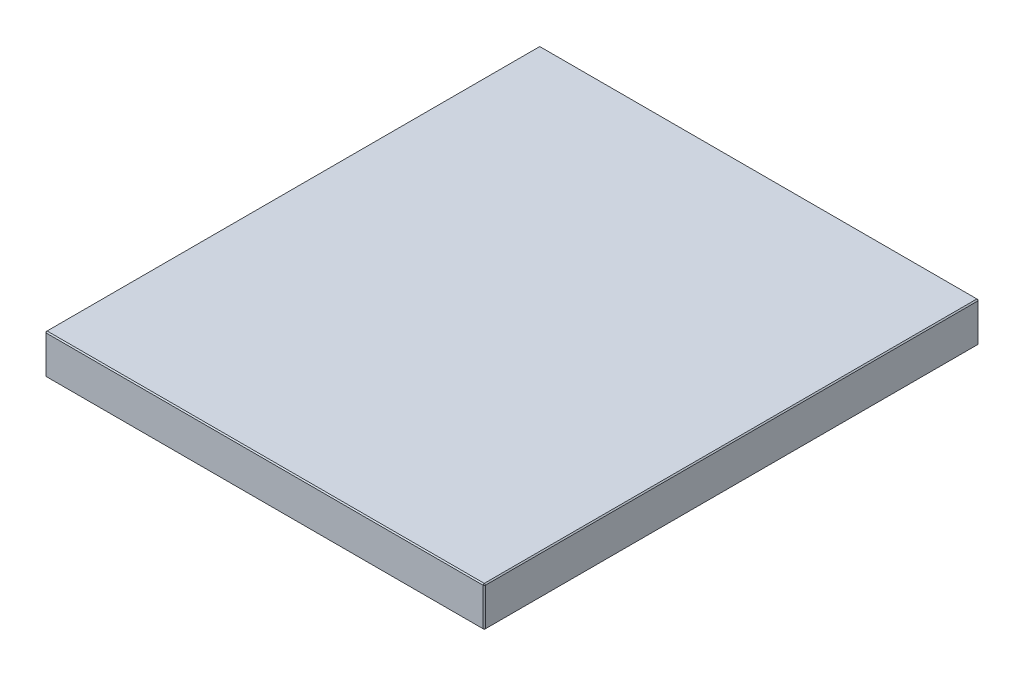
ISO-10303-21;
HEADER;
FILE_DESCRIPTION(('STEP AP214'),'2;1');
FILE_NAME('part.step','',(''),(''),'','','');
FILE_SCHEMA(('AUTOMOTIVE_DESIGN { 1 0 10303 214 1 1 1 1 }'));
ENDSEC;
DATA;
#1=APPLICATION_CONTEXT('core data for automotive mechanical design processes');
#2=APPLICATION_PROTOCOL_DEFINITION('international standard','automotive_design',2000,#1);
#3=PRODUCT_CONTEXT('',#1,'mechanical');
#4=PRODUCT('Part','Part','',(#3));
#5=PRODUCT_RELATED_PRODUCT_CATEGORY('part','',(#4));
#6=PRODUCT_DEFINITION_FORMATION('','',#4);
#7=PRODUCT_DEFINITION_CONTEXT('part definition',#1,'design');
#8=PRODUCT_DEFINITION('design','',#6,#7);
#9=PRODUCT_DEFINITION_SHAPE('','',#8);
#10=(LENGTH_UNIT() NAMED_UNIT(*) SI_UNIT(.MILLI.,.METRE.));
#11=(NAMED_UNIT(*) PLANE_ANGLE_UNIT() SI_UNIT($,.RADIAN.));
#12=(NAMED_UNIT(*) SI_UNIT($,.STERADIAN.) SOLID_ANGLE_UNIT());
#13=UNCERTAINTY_MEASURE_WITH_UNIT(LENGTH_MEASURE(1.E-05),#10,'distance_accuracy_value','');
#14=(GEOMETRIC_REPRESENTATION_CONTEXT(3) GLOBAL_UNCERTAINTY_ASSIGNED_CONTEXT((#13)) GLOBAL_UNIT_ASSIGNED_CONTEXT((#10,
#11,#12)) REPRESENTATION_CONTEXT('',''));
#15=CARTESIAN_POINT('',(0.,0.,0.));
#16=DIRECTION('',(0.,0.,1.));
#17=DIRECTION('',(1.,0.,0.));
#18=AXIS2_PLACEMENT_3D('',#15,#16,#17);
#19=CARTESIAN_POINT('',(198.,36.,223.));
#20=DIRECTION('',(-1.,0.,0.));
#21=DIRECTION('',(0.,0.,1.));
#22=AXIS2_PLACEMENT_3D('',#19,#20,#21);
#23=PLANE('',#22);
#24=DIRECTION('',(0.,0.,-1.));
#25=VECTOR('',#24,1.);
#26=CARTESIAN_POINT('',(198.,1.00000000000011,-223.));
#27=LINE('',#26,#25);
#28=CARTESIAN_POINT('',(198.,1.00000000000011,222.));
#29=VERTEX_POINT('',#28);
#30=CARTESIAN_POINT('',(198.,1.00000000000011,-222.));
#31=VERTEX_POINT('',#30);
#32=EDGE_CURVE('E151',#29,#31,#27,.T.);
#33=ORIENTED_EDGE('',*,*,#32,.T.);
#34=DIRECTION('',(0.,1.,0.));
#35=VECTOR('',#34,1.);
#36=CARTESIAN_POINT('',(198.,36.,-222.));
#37=LINE('',#36,#35);
#38=CARTESIAN_POINT('',(198.,35.,-222.));
#39=VERTEX_POINT('',#38);
#40=EDGE_CURVE('E153',#31,#39,#37,.T.);
#41=ORIENTED_EDGE('',*,*,#40,.T.);
#42=DIRECTION('',(0.,0.,1.));
#43=VECTOR('',#42,1.);
#44=CARTESIAN_POINT('',(198.,35.,223.));
#45=LINE('',#44,#43);
#46=CARTESIAN_POINT('',(198.,35.,222.));
#47=VERTEX_POINT('',#46);
#48=EDGE_CURVE('E147',#39,#47,#45,.T.);
#49=ORIENTED_EDGE('',*,*,#48,.T.);
#50=DIRECTION('',(0.,-1.,0.));
#51=VECTOR('',#50,1.);
#52=CARTESIAN_POINT('',(198.,36.,222.));
#53=LINE('',#52,#51);
#54=EDGE_CURVE('E149',#47,#29,#53,.T.);
#55=ORIENTED_EDGE('',*,*,#54,.T.);
#56=EDGE_LOOP('',(#33,#41,#49,#55));
#57=FACE_BOUND('',#56,.T.);
#58=ADVANCED_FACE('F16',(#57),#23,.F.);
#59=CARTESIAN_POINT('',(-198.,36.,-223.));
#60=DIRECTION('',(0.,0.,1.));
#61=DIRECTION('',(1.,0.,0.));
#62=AXIS2_PLACEMENT_3D('',#59,#60,#61);
#63=PLANE('',#62);
#64=DIRECTION('',(0.,-1.,0.));
#65=VECTOR('',#64,1.);
#66=CARTESIAN_POINT('',(197.,36.,-223.));
#67=LINE('',#66,#65);
#68=CARTESIAN_POINT('',(197.,35.,-223.));
#69=VERTEX_POINT('',#68);
#70=CARTESIAN_POINT('',(197.,1.00000000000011,-223.));
#71=VERTEX_POINT('',#70);
#72=EDGE_CURVE('E115',#69,#71,#67,.T.);
#73=ORIENTED_EDGE('',*,*,#72,.T.);
#74=DIRECTION('',(-1.,0.,0.));
#75=VECTOR('',#74,1.);
#76=CARTESIAN_POINT('',(-198.,1.00000000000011,-223.));
#77=LINE('',#76,#75);
#78=CARTESIAN_POINT('',(-197.,1.00000000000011,-223.));
#79=VERTEX_POINT('',#78);
#80=EDGE_CURVE('E111',#71,#79,#77,.T.);
#81=ORIENTED_EDGE('',*,*,#80,.T.);
#82=DIRECTION('',(0.,1.,0.));
#83=VECTOR('',#82,1.);
#84=CARTESIAN_POINT('',(-197.,36.,-223.));
#85=LINE('',#84,#83);
#86=CARTESIAN_POINT('',(-197.,35.,-223.));
#87=VERTEX_POINT('',#86);
#88=EDGE_CURVE('E103',#79,#87,#85,.T.);
#89=ORIENTED_EDGE('',*,*,#88,.T.);
#90=DIRECTION('',(1.,0.,0.));
#91=VECTOR('',#90,1.);
#92=CARTESIAN_POINT('',(-198.,35.,-223.));
#93=LINE('',#92,#91);
#94=EDGE_CURVE('E108',#87,#69,#93,.T.);
#95=ORIENTED_EDGE('',*,*,#94,.T.);
#96=EDGE_LOOP('',(#73,#81,#89,#95));
#97=FACE_BOUND('',#96,.T.);
#98=ADVANCED_FACE('F106',(#97),#63,.F.);
#99=CARTESIAN_POINT('',(-198.,36.,223.));
#100=DIRECTION('',(1.,0.,0.));
#101=DIRECTION('',(0.,0.,-1.));
#102=AXIS2_PLACEMENT_3D('',#99,#100,#101);
#103=PLANE('',#102);
#104=DIRECTION('',(0.,-1.,0.));
#105=VECTOR('',#104,1.);
#106=CARTESIAN_POINT('',(-198.,36.,-222.));
#107=LINE('',#106,#105);
#108=CARTESIAN_POINT('',(-198.,35.,-222.));
#109=VERTEX_POINT('',#108);
#110=CARTESIAN_POINT('',(-198.,1.00000000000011,-222.));
#111=VERTEX_POINT('',#110);
#112=EDGE_CURVE('E123',#109,#111,#107,.T.);
#113=ORIENTED_EDGE('',*,*,#112,.T.);
#114=DIRECTION('',(0.,0.,1.));
#115=VECTOR('',#114,1.);
#116=CARTESIAN_POINT('',(-198.,1.00000000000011,223.));
#117=LINE('',#116,#115);
#118=CARTESIAN_POINT('',(-198.,1.00000000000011,222.));
#119=VERTEX_POINT('',#118);
#120=EDGE_CURVE('E161',#111,#119,#117,.T.);
#121=ORIENTED_EDGE('',*,*,#120,.T.);
#122=DIRECTION('',(0.,1.,0.));
#123=VECTOR('',#122,1.);
#124=CARTESIAN_POINT('',(-198.,36.,222.));
#125=LINE('',#124,#123);
#126=CARTESIAN_POINT('',(-198.,35.,222.));
#127=VERTEX_POINT('',#126);
#128=EDGE_CURVE('E158',#119,#127,#125,.T.);
#129=ORIENTED_EDGE('',*,*,#128,.T.);
#130=DIRECTION('',(0.,0.,-1.));
#131=VECTOR('',#130,1.);
#132=CARTESIAN_POINT('',(-198.,35.,223.));
#133=LINE('',#132,#131);
#134=EDGE_CURVE('E156',#127,#109,#133,.T.);
#135=ORIENTED_EDGE('',*,*,#134,.T.);
#136=EDGE_LOOP('',(#113,#121,#129,#135));
#137=FACE_BOUND('',#136,.T.);
#138=ADVANCED_FACE('F310',(#137),#103,.F.);
#139=CARTESIAN_POINT('',(-198.,36.,223.));
#140=DIRECTION('',(0.,0.,-1.));
#141=DIRECTION('',(-1.,0.,0.));
#142=AXIS2_PLACEMENT_3D('',#139,#140,#141);
#143=PLANE('',#142);
#144=DIRECTION('',(-1.,0.,0.));
#145=VECTOR('',#144,1.);
#146=CARTESIAN_POINT('',(-198.,35.,223.));
#147=LINE('',#146,#145);
#148=CARTESIAN_POINT('',(197.,35.,223.));
#149=VERTEX_POINT('',#148);
#150=CARTESIAN_POINT('',(-197.,35.,223.));
#151=VERTEX_POINT('',#150);
#152=EDGE_CURVE('E163',#149,#151,#147,.T.);
#153=ORIENTED_EDGE('',*,*,#152,.T.);
#154=DIRECTION('',(0.,-1.,0.));
#155=VECTOR('',#154,1.);
#156=CARTESIAN_POINT('',(-197.,36.,223.));
#157=LINE('',#156,#155);
#158=CARTESIAN_POINT('',(-197.,1.00000000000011,223.));
#159=VERTEX_POINT('',#158);
#160=EDGE_CURVE('E169',#151,#159,#157,.T.);
#161=ORIENTED_EDGE('',*,*,#160,.T.);
#162=DIRECTION('',(1.,0.,0.));
#163=VECTOR('',#162,1.);
#164=CARTESIAN_POINT('',(198.,1.00000000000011,223.));
#165=LINE('',#164,#163);
#166=CARTESIAN_POINT('',(197.,1.00000000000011,223.));
#167=VERTEX_POINT('',#166);
#168=EDGE_CURVE('E167',#159,#167,#165,.T.);
#169=ORIENTED_EDGE('',*,*,#168,.T.);
#170=DIRECTION('',(0.,1.,0.));
#171=VECTOR('',#170,1.);
#172=CARTESIAN_POINT('',(197.,36.,223.));
#173=LINE('',#172,#171);
#174=EDGE_CURVE('E165',#167,#149,#173,.T.);
#175=ORIENTED_EDGE('',*,*,#174,.T.);
#176=EDGE_LOOP('',(#153,#161,#169,#175));
#177=FACE_BOUND('',#176,.T.);
#178=ADVANCED_FACE('F256',(#177),#143,.F.);
#179=CARTESIAN_POINT('',(0.,36.,0.));
#180=DIRECTION('',(0.,-1.,0.));
#181=DIRECTION('',(0.,0.,-1.));
#182=AXIS2_PLACEMENT_3D('',#179,#180,#181);
#183=PLANE('',#182);
#184=DIRECTION('',(0.,0.,1.));
#185=VECTOR('',#184,1.);
#186=CARTESIAN_POINT('',(-197.,36.,0.));
#187=LINE('',#186,#185);
#188=CARTESIAN_POINT('',(-197.,36.,-222.));
#189=VERTEX_POINT('',#188);
#190=CARTESIAN_POINT('',(-197.,36.,222.));
#191=VERTEX_POINT('',#190);
#192=EDGE_CURVE('E25',#189,#191,#187,.T.);
#193=ORIENTED_EDGE('',*,*,#192,.T.);
#194=DIRECTION('',(1.,0.,0.));
#195=VECTOR('',#194,1.);
#196=CARTESIAN_POINT('',(0.,36.,222.));
#197=LINE('',#196,#195);
#198=CARTESIAN_POINT('',(197.,36.,222.));
#199=VERTEX_POINT('',#198);
#200=EDGE_CURVE('E10',#191,#199,#197,.T.);
#201=ORIENTED_EDGE('',*,*,#200,.T.);
#202=DIRECTION('',(0.,0.,-1.));
#203=VECTOR('',#202,1.);
#204=CARTESIAN_POINT('',(197.,36.,0.));
#205=LINE('',#204,#203);
#206=CARTESIAN_POINT('',(197.,36.,-222.));
#207=VERTEX_POINT('',#206);
#208=EDGE_CURVE('E181',#199,#207,#205,.T.);
#209=ORIENTED_EDGE('',*,*,#208,.T.);
#210=DIRECTION('',(-1.,0.,0.));
#211=VECTOR('',#210,1.);
#212=CARTESIAN_POINT('',(0.,36.,-222.));
#213=LINE('',#212,#211);
#214=EDGE_CURVE('E36',#207,#189,#213,.T.);
#215=ORIENTED_EDGE('',*,*,#214,.T.);
#216=EDGE_LOOP('',(#193,#201,#209,#215));
#217=FACE_BOUND('',#216,.T.);
#218=ADVANCED_FACE('F271',(#217),#183,.F.);
#219=CARTESIAN_POINT('',(0.,0.,0.));
#220=DIRECTION('',(0.,-1.,0.));
#221=DIRECTION('',(0.,0.,-1.));
#222=AXIS2_PLACEMENT_3D('',#219,#220,#221);
#223=PLANE('',#222);
#224=DIRECTION('',(0.,0.,-1.));
#225=VECTOR('',#224,1.);
#226=CARTESIAN_POINT('',(-197.,0.,-223.));
#227=LINE('',#226,#225);
#228=CARTESIAN_POINT('',(-197.,0.,222.));
#229=VERTEX_POINT('',#228);
#230=CARTESIAN_POINT('',(-197.,0.,-222.));
#231=VERTEX_POINT('',#230);
#232=EDGE_CURVE('E176',#229,#231,#227,.T.);
#233=ORIENTED_EDGE('',*,*,#232,.T.);
#234=DIRECTION('',(1.,0.,0.));
#235=VECTOR('',#234,1.);
#236=CARTESIAN_POINT('',(198.,0.,-222.));
#237=LINE('',#236,#235);
#238=CARTESIAN_POINT('',(197.,0.,-222.));
#239=VERTEX_POINT('',#238);
#240=EDGE_CURVE('E178',#231,#239,#237,.T.);
#241=ORIENTED_EDGE('',*,*,#240,.T.);
#242=DIRECTION('',(0.,0.,1.));
#243=VECTOR('',#242,1.);
#244=CARTESIAN_POINT('',(197.,0.,223.));
#245=LINE('',#244,#243);
#246=CARTESIAN_POINT('',(197.,0.,222.));
#247=VERTEX_POINT('',#246);
#248=EDGE_CURVE('E172',#239,#247,#245,.T.);
#249=ORIENTED_EDGE('',*,*,#248,.T.);
#250=DIRECTION('',(-1.,0.,0.));
#251=VECTOR('',#250,1.);
#252=CARTESIAN_POINT('',(-198.,0.,222.));
#253=LINE('',#252,#251);
#254=EDGE_CURVE('E174',#247,#229,#253,.T.);
#255=ORIENTED_EDGE('',*,*,#254,.T.);
#256=EDGE_LOOP('',(#233,#241,#249,#255));
#257=FACE_BOUND('',#256,.T.);
#258=ADVANCED_FACE('F247',(#257),#223,.T.);
#259=CARTESIAN_POINT('',(-197.,36.,223.));
#260=DIRECTION('',(0.707106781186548,0.,-0.707106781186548));
#261=DIRECTION('',(0.,-1.,0.));
#262=AXIS2_PLACEMENT_3D('',#259,#260,#261);
#263=PLANE('',#262);
#264=DIRECTION('',(-0.707106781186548,0.,-0.707106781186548));
#265=VECTOR('',#264,1.);
#266=CARTESIAN_POINT('',(-198.,35.,222.));
#267=LINE('',#266,#265);
#268=EDGE_CURVE('E20',#127,#151,#267,.F.);
#269=ORIENTED_EDGE('',*,*,#268,.F.);
#270=ORIENTED_EDGE('',*,*,#128,.F.);
#271=DIRECTION('',(0.707106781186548,0.,0.707106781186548));
#272=VECTOR('',#271,1.);
#273=CARTESIAN_POINT('',(-197.,1.00000000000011,223.));
#274=LINE('',#273,#272);
#275=EDGE_CURVE('E143',#159,#119,#274,.F.);
#276=ORIENTED_EDGE('',*,*,#275,.F.);
#277=ORIENTED_EDGE('',*,*,#160,.F.);
#278=EDGE_LOOP('',(#269,#270,#276,#277));
#279=FACE_BOUND('',#278,.T.);
#280=ADVANCED_FACE('F18',(#279),#263,.F.);
#281=CARTESIAN_POINT('',(-198.,35.,222.));
#282=DIRECTION('',(-0.577350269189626,0.577350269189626,0.577350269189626));
#283=DIRECTION('',(0.707106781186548,0.,0.707106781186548));
#284=AXIS2_PLACEMENT_3D('',#281,#282,#283);
#285=PLANE('',#284);
#286=DIRECTION('',(0.707106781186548,0.707106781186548,0.));
#287=VECTOR('',#286,1.);
#288=CARTESIAN_POINT('',(-198.,35.,222.));
#289=LINE('',#288,#287);
#290=EDGE_CURVE('E227',#127,#191,#289,.T.);
#291=ORIENTED_EDGE('',*,*,#290,.F.);
#292=ORIENTED_EDGE('',*,*,#268,.T.);
#293=DIRECTION('',(0.,-0.707106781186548,0.707106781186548));
#294=VECTOR('',#293,1.);
#295=CARTESIAN_POINT('',(-197.,35.5,222.5));
#296=LINE('',#295,#294);
#297=EDGE_CURVE('E229',#191,#151,#296,.T.);
#298=ORIENTED_EDGE('',*,*,#297,.F.);
#299=EDGE_LOOP('',(#291,#292,#298));
#300=FACE_BOUND('',#299,.T.);
#301=ADVANCED_FACE('F460',(#300),#285,.T.);
#302=CARTESIAN_POINT('',(-197.,1.00000000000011,223.));
#303=DIRECTION('',(-0.577350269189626,-0.577350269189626,0.577350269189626));
#304=DIRECTION('',(0.707106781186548,0.,0.707106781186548));
#305=AXIS2_PLACEMENT_3D('',#302,#303,#304);
#306=PLANE('',#305);
#307=DIRECTION('',(0.,0.707106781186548,0.707106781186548));
#308=VECTOR('',#307,1.);
#309=CARTESIAN_POINT('',(-197.,1.00000000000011,223.));
#310=LINE('',#309,#308);
#311=EDGE_CURVE('E221',#159,#229,#310,.F.);
#312=ORIENTED_EDGE('',*,*,#311,.F.);
#313=ORIENTED_EDGE('',*,*,#275,.T.);
#314=DIRECTION('',(0.707106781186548,-0.707106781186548,0.));
#315=VECTOR('',#314,1.);
#316=CARTESIAN_POINT('',(-197.5,0.500000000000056,222.));
#317=LINE('',#316,#315);
#318=EDGE_CURVE('E224',#229,#119,#317,.F.);
#319=ORIENTED_EDGE('',*,*,#318,.F.);
#320=EDGE_LOOP('',(#312,#313,#319));
#321=FACE_BOUND('',#320,.T.);
#322=ADVANCED_FACE('F236',(#321),#306,.T.);
#323=CARTESIAN_POINT('',(0.,36.,222.));
#324=DIRECTION('',(0.,-0.707106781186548,-0.707106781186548));
#325=DIRECTION('',(1.,0.,0.));
#326=AXIS2_PLACEMENT_3D('',#323,#324,#325);
#327=PLANE('',#326);
#328=ORIENTED_EDGE('',*,*,#297,.T.);
#329=ORIENTED_EDGE('',*,*,#152,.F.);
#330=DIRECTION('',(0.,0.707106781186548,-0.707106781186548));
#331=VECTOR('',#330,1.);
#332=CARTESIAN_POINT('',(197.,35.,223.));
#333=LINE('',#332,#331);
#334=EDGE_CURVE('E215',#199,#149,#333,.F.);
#335=ORIENTED_EDGE('',*,*,#334,.F.);
#336=ORIENTED_EDGE('',*,*,#200,.F.);
#337=EDGE_LOOP('',(#328,#329,#335,#336));
#338=FACE_BOUND('',#337,.T.);
#339=ADVANCED_FACE('F270',(#338),#327,.F.);
#340=CARTESIAN_POINT('',(-197.,36.,0.));
#341=DIRECTION('',(0.707106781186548,-0.707106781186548,0.));
#342=DIRECTION('',(0.,0.,1.));
#343=AXIS2_PLACEMENT_3D('',#340,#341,#342);
#344=PLANE('',#343);
#345=ORIENTED_EDGE('',*,*,#290,.T.);
#346=ORIENTED_EDGE('',*,*,#192,.F.);
#347=DIRECTION('',(-0.707106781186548,-0.707106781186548,0.));
#348=VECTOR('',#347,1.);
#349=CARTESIAN_POINT('',(-197.5,35.5,-222.));
#350=LINE('',#349,#348);
#351=EDGE_CURVE('E127',#109,#189,#350,.F.);
#352=ORIENTED_EDGE('',*,*,#351,.F.);
#353=ORIENTED_EDGE('',*,*,#134,.F.);
#354=EDGE_LOOP('',(#345,#346,#352,#353));
#355=FACE_BOUND('',#354,.T.);
#356=ADVANCED_FACE('F437',(#355),#344,.F.);
#357=CARTESIAN_POINT('',(-198.,36.,-222.));
#358=DIRECTION('',(0.707106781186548,0.,0.707106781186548));
#359=DIRECTION('',(0.,-1.,0.));
#360=AXIS2_PLACEMENT_3D('',#357,#358,#359);
#361=PLANE('',#360);
#362=DIRECTION('',(-0.707106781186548,0.,0.707106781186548));
#363=VECTOR('',#362,1.);
#364=CARTESIAN_POINT('',(-198.,1.00000000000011,-222.));
#365=LINE('',#364,#363);
#366=EDGE_CURVE('E128',#111,#79,#365,.F.);
#367=ORIENTED_EDGE('',*,*,#366,.F.);
#368=ORIENTED_EDGE('',*,*,#112,.F.);
#369=DIRECTION('',(0.707106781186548,0.,-0.707106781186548));
#370=VECTOR('',#369,1.);
#371=CARTESIAN_POINT('',(-197.,35.,-223.));
#372=LINE('',#371,#370);
#373=EDGE_CURVE('E119',#87,#109,#372,.F.);
#374=ORIENTED_EDGE('',*,*,#373,.F.);
#375=ORIENTED_EDGE('',*,*,#88,.F.);
#376=EDGE_LOOP('',(#367,#368,#374,#375));
#377=FACE_BOUND('',#376,.T.);
#378=ADVANCED_FACE('F121',(#377),#361,.F.);
#379=CARTESIAN_POINT('',(-198.,1.00000000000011,223.));
#380=DIRECTION('',(-0.707106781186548,-0.707106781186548,0.));
#381=DIRECTION('',(0.,0.,-1.));
#382=AXIS2_PLACEMENT_3D('',#379,#380,#381);
#383=PLANE('',#382);
#384=ORIENTED_EDGE('',*,*,#318,.T.);
#385=ORIENTED_EDGE('',*,*,#120,.F.);
#386=DIRECTION('',(-0.707106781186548,0.707106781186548,0.));
#387=VECTOR('',#386,1.);
#388=CARTESIAN_POINT('',(-198.,1.00000000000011,-222.));
#389=LINE('',#388,#387);
#390=EDGE_CURVE('E211',#231,#111,#389,.T.);
#391=ORIENTED_EDGE('',*,*,#390,.F.);
#392=ORIENTED_EDGE('',*,*,#232,.F.);
#393=EDGE_LOOP('',(#384,#385,#391,#392));
#394=FACE_BOUND('',#393,.T.);
#395=ADVANCED_FACE('F243',(#394),#383,.T.);
#396=CARTESIAN_POINT('',(-198.,1.00000000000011,223.));
#397=DIRECTION('',(0.,-0.707106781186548,0.707106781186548));
#398=DIRECTION('',(-1.,0.,0.));
#399=AXIS2_PLACEMENT_3D('',#396,#397,#398);
#400=PLANE('',#399);
#401=ORIENTED_EDGE('',*,*,#311,.T.);
#402=ORIENTED_EDGE('',*,*,#254,.F.);
#403=DIRECTION('',(0.,-0.707106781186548,-0.707106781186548));
#404=VECTOR('',#403,1.);
#405=CARTESIAN_POINT('',(197.,1.00000000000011,223.));
#406=LINE('',#405,#404);
#407=EDGE_CURVE('E208',#167,#247,#406,.T.);
#408=ORIENTED_EDGE('',*,*,#407,.F.);
#409=ORIENTED_EDGE('',*,*,#168,.F.);
#410=EDGE_LOOP('',(#401,#402,#408,#409));
#411=FACE_BOUND('',#410,.T.);
#412=ADVANCED_FACE('F253',(#411),#400,.T.);
#413=CARTESIAN_POINT('',(198.,36.,222.));
#414=DIRECTION('',(-0.707106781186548,0.,-0.707106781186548));
#415=DIRECTION('',(0.,-1.,0.));
#416=AXIS2_PLACEMENT_3D('',#413,#414,#415);
#417=PLANE('',#416);
#418=DIRECTION('',(-0.707106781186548,0.,0.707106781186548));
#419=VECTOR('',#418,1.);
#420=CARTESIAN_POINT('',(197.,35.,223.));
#421=LINE('',#420,#419);
#422=EDGE_CURVE('E218',#149,#47,#421,.F.);
#423=ORIENTED_EDGE('',*,*,#422,.F.);
#424=ORIENTED_EDGE('',*,*,#174,.F.);
#425=DIRECTION('',(0.707106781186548,0.,-0.707106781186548));
#426=VECTOR('',#425,1.);
#427=CARTESIAN_POINT('',(197.,1.00000000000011,223.));
#428=LINE('',#427,#426);
#429=EDGE_CURVE('E205',#29,#167,#428,.F.);
#430=ORIENTED_EDGE('',*,*,#429,.F.);
#431=ORIENTED_EDGE('',*,*,#54,.F.);
#432=EDGE_LOOP('',(#423,#424,#430,#431));
#433=FACE_BOUND('',#432,.T.);
#434=ADVANCED_FACE('F261',(#433),#417,.F.);
#435=CARTESIAN_POINT('',(197.,35.,223.));
#436=DIRECTION('',(0.577350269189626,0.577350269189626,0.577350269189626));
#437=DIRECTION('',(0.707106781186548,0.,-0.707106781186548));
#438=AXIS2_PLACEMENT_3D('',#435,#436,#437);
#439=PLANE('',#438);
#440=ORIENTED_EDGE('',*,*,#334,.T.);
#441=ORIENTED_EDGE('',*,*,#422,.T.);
#442=DIRECTION('',(0.707106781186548,-0.707106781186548,0.));
#443=VECTOR('',#442,1.);
#444=CARTESIAN_POINT('',(197.5,35.5,222.));
#445=LINE('',#444,#443);
#446=EDGE_CURVE('E134',#199,#47,#445,.T.);
#447=ORIENTED_EDGE('',*,*,#446,.F.);
#448=EDGE_LOOP('',(#440,#441,#447));
#449=FACE_BOUND('',#448,.T.);
#450=ADVANCED_FACE('F267',(#449),#439,.T.);
#451=CARTESIAN_POINT('',(-197.,35.,-223.));
#452=DIRECTION('',(-0.577350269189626,0.577350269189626,-0.577350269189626));
#453=DIRECTION('',(-0.707106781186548,0.,0.707106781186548));
#454=AXIS2_PLACEMENT_3D('',#451,#452,#453);
#455=PLANE('',#454);
#456=ORIENTED_EDGE('',*,*,#373,.T.);
#457=ORIENTED_EDGE('',*,*,#351,.T.);
#458=DIRECTION('',(0.,0.707106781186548,0.707106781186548));
#459=VECTOR('',#458,1.);
#460=CARTESIAN_POINT('',(-197.,35.,-223.));
#461=LINE('',#460,#459);
#462=EDGE_CURVE('E131',#87,#189,#461,.T.);
#463=ORIENTED_EDGE('',*,*,#462,.F.);
#464=EDGE_LOOP('',(#456,#457,#463));
#465=FACE_BOUND('',#464,.T.);
#466=ADVANCED_FACE('F132',(#465),#455,.T.);
#467=CARTESIAN_POINT('',(-198.,1.00000000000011,-222.));
#468=DIRECTION('',(-0.577350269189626,-0.577350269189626,-0.577350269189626));
#469=DIRECTION('',(-0.707106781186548,0.,0.707106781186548));
#470=AXIS2_PLACEMENT_3D('',#467,#468,#469);
#471=PLANE('',#470);
#472=ORIENTED_EDGE('',*,*,#390,.T.);
#473=ORIENTED_EDGE('',*,*,#366,.T.);
#474=DIRECTION('',(0.,-0.707106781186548,0.707106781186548));
#475=VECTOR('',#474,1.);
#476=CARTESIAN_POINT('',(-197.,0.500000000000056,-222.5));
#477=LINE('',#476,#475);
#478=EDGE_CURVE('E135',#231,#79,#477,.F.);
#479=ORIENTED_EDGE('',*,*,#478,.F.);
#480=EDGE_LOOP('',(#472,#473,#479));
#481=FACE_BOUND('',#480,.T.);
#482=ADVANCED_FACE('F290',(#481),#471,.T.);
#483=CARTESIAN_POINT('',(197.,1.00000000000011,223.));
#484=DIRECTION('',(0.577350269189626,-0.577350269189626,0.577350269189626));
#485=DIRECTION('',(0.707106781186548,0.,-0.707106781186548));
#486=AXIS2_PLACEMENT_3D('',#483,#484,#485);
#487=PLANE('',#486);
#488=ORIENTED_EDGE('',*,*,#429,.T.);
#489=ORIENTED_EDGE('',*,*,#407,.T.);
#490=DIRECTION('',(0.707106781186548,0.707106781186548,0.));
#491=VECTOR('',#490,1.);
#492=CARTESIAN_POINT('',(197.5,0.500000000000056,222.));
#493=LINE('',#492,#491);
#494=EDGE_CURVE('E198',#29,#247,#493,.F.);
#495=ORIENTED_EDGE('',*,*,#494,.F.);
#496=EDGE_LOOP('',(#488,#489,#495));
#497=FACE_BOUND('',#496,.T.);
#498=ADVANCED_FACE('F292',(#497),#487,.T.);
#499=CARTESIAN_POINT('',(197.,36.,0.));
#500=DIRECTION('',(-0.707106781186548,-0.707106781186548,0.));
#501=DIRECTION('',(0.,0.,-1.));
#502=AXIS2_PLACEMENT_3D('',#499,#500,#501);
#503=PLANE('',#502);
#504=ORIENTED_EDGE('',*,*,#446,.T.);
#505=ORIENTED_EDGE('',*,*,#48,.F.);
#506=DIRECTION('',(-0.707106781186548,0.707106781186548,0.));
#507=VECTOR('',#506,1.);
#508=CARTESIAN_POINT('',(198.,35.,-222.));
#509=LINE('',#508,#507);
#510=EDGE_CURVE('E195',#207,#39,#509,.F.);
#511=ORIENTED_EDGE('',*,*,#510,.F.);
#512=ORIENTED_EDGE('',*,*,#208,.F.);
#513=EDGE_LOOP('',(#504,#505,#511,#512));
#514=FACE_BOUND('',#513,.T.);
#515=ADVANCED_FACE('F275',(#514),#503,.F.);
#516=CARTESIAN_POINT('',(0.,36.,-222.));
#517=DIRECTION('',(0.,-0.707106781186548,0.707106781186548));
#518=DIRECTION('',(-1.,0.,0.));
#519=AXIS2_PLACEMENT_3D('',#516,#517,#518);
#520=PLANE('',#519);
#521=ORIENTED_EDGE('',*,*,#462,.T.);
#522=ORIENTED_EDGE('',*,*,#214,.F.);
#523=DIRECTION('',(0.,-0.707106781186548,-0.707106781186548));
#524=VECTOR('',#523,1.);
#525=CARTESIAN_POINT('',(197.,35.5,-222.5));
#526=LINE('',#525,#524);
#527=EDGE_CURVE('E139',#69,#207,#526,.F.);
#528=ORIENTED_EDGE('',*,*,#527,.F.);
#529=ORIENTED_EDGE('',*,*,#94,.F.);
#530=EDGE_LOOP('',(#521,#522,#528,#529));
#531=FACE_BOUND('',#530,.T.);
#532=ADVANCED_FACE('F137',(#531),#520,.F.);
#533=CARTESIAN_POINT('',(-198.,1.00000000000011,-223.));
#534=DIRECTION('',(0.,-0.707106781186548,-0.707106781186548));
#535=DIRECTION('',(1.,0.,0.));
#536=AXIS2_PLACEMENT_3D('',#533,#534,#535);
#537=PLANE('',#536);
#538=ORIENTED_EDGE('',*,*,#478,.T.);
#539=ORIENTED_EDGE('',*,*,#80,.F.);
#540=DIRECTION('',(0.,0.707106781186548,-0.707106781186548));
#541=VECTOR('',#540,1.);
#542=CARTESIAN_POINT('',(197.,1.00000000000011,-223.));
#543=LINE('',#542,#541);
#544=EDGE_CURVE('E191',#239,#71,#543,.T.);
#545=ORIENTED_EDGE('',*,*,#544,.F.);
#546=ORIENTED_EDGE('',*,*,#240,.F.);
#547=EDGE_LOOP('',(#538,#539,#545,#546));
#548=FACE_BOUND('',#547,.T.);
#549=ADVANCED_FACE('F288',(#548),#537,.T.);
#550=CARTESIAN_POINT('',(198.,1.00000000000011,223.));
#551=DIRECTION('',(0.707106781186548,-0.707106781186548,0.));
#552=DIRECTION('',(0.,0.,1.));
#553=AXIS2_PLACEMENT_3D('',#550,#551,#552);
#554=PLANE('',#553);
#555=ORIENTED_EDGE('',*,*,#494,.T.);
#556=ORIENTED_EDGE('',*,*,#248,.F.);
#557=DIRECTION('',(-0.707106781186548,-0.707106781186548,0.));
#558=VECTOR('',#557,1.);
#559=CARTESIAN_POINT('',(197.5,0.500000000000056,-222.));
#560=LINE('',#559,#558);
#561=EDGE_CURVE('E189',#31,#239,#560,.T.);
#562=ORIENTED_EDGE('',*,*,#561,.F.);
#563=ORIENTED_EDGE('',*,*,#32,.F.);
#564=EDGE_LOOP('',(#555,#556,#562,#563));
#565=FACE_BOUND('',#564,.T.);
#566=ADVANCED_FACE('F320',(#565),#554,.T.);
#567=CARTESIAN_POINT('',(198.,35.,-222.));
#568=DIRECTION('',(0.577350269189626,0.577350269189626,-0.577350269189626));
#569=DIRECTION('',(-0.707106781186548,0.,-0.707106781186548));
#570=AXIS2_PLACEMENT_3D('',#567,#568,#569);
#571=PLANE('',#570);
#572=ORIENTED_EDGE('',*,*,#527,.T.);
#573=ORIENTED_EDGE('',*,*,#510,.T.);
#574=DIRECTION('',(0.707106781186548,0.,0.707106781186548));
#575=VECTOR('',#574,1.);
#576=CARTESIAN_POINT('',(198.,35.,-222.));
#577=LINE('',#576,#575);
#578=EDGE_CURVE('E187',#69,#39,#577,.T.);
#579=ORIENTED_EDGE('',*,*,#578,.F.);
#580=EDGE_LOOP('',(#572,#573,#579));
#581=FACE_BOUND('',#580,.T.);
#582=ADVANCED_FACE('F277',(#581),#571,.T.);
#583=CARTESIAN_POINT('',(197.,1.00000000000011,-223.));
#584=DIRECTION('',(0.577350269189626,-0.577350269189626,-0.577350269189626));
#585=DIRECTION('',(-0.707106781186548,0.,-0.707106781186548));
#586=AXIS2_PLACEMENT_3D('',#583,#584,#585);
#587=PLANE('',#586);
#588=ORIENTED_EDGE('',*,*,#561,.T.);
#589=ORIENTED_EDGE('',*,*,#544,.T.);
#590=DIRECTION('',(-0.707106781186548,0.,-0.707106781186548));
#591=VECTOR('',#590,1.);
#592=CARTESIAN_POINT('',(197.,1.00000000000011,-223.));
#593=LINE('',#592,#591);
#594=EDGE_CURVE('E185',#31,#71,#593,.T.);
#595=ORIENTED_EDGE('',*,*,#594,.F.);
#596=EDGE_LOOP('',(#588,#589,#595));
#597=FACE_BOUND('',#596,.T.);
#598=ADVANCED_FACE('F285',(#597),#587,.T.);
#599=CARTESIAN_POINT('',(197.,36.,-223.));
#600=DIRECTION('',(-0.707106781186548,0.,0.707106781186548));
#601=DIRECTION('',(0.,-1.,0.));
#602=AXIS2_PLACEMENT_3D('',#599,#600,#601);
#603=PLANE('',#602);
#604=ORIENTED_EDGE('',*,*,#578,.T.);
#605=ORIENTED_EDGE('',*,*,#40,.F.);
#606=ORIENTED_EDGE('',*,*,#594,.T.);
#607=ORIENTED_EDGE('',*,*,#72,.F.);
#608=EDGE_LOOP('',(#604,#605,#606,#607));
#609=FACE_BOUND('',#608,.T.);
#610=ADVANCED_FACE('F281',(#609),#603,.F.);
#611=CLOSED_SHELL('',(#58,#98,#138,#178,#218,#258,#280,#301,#322,#339,#356,#378,#395,#412,#434,
#450,#466,#482,#498,#515,#532,#549,#566,#582,#598,#610));
#612=MANIFOLD_SOLID_BREP('B1',#611);
#613=ADVANCED_BREP_SHAPE_REPRESENTATION('',(#18,#612),#14);
#614=SHAPE_DEFINITION_REPRESENTATION(#9,#613);
ENDSEC;
END-ISO-10303-21;
